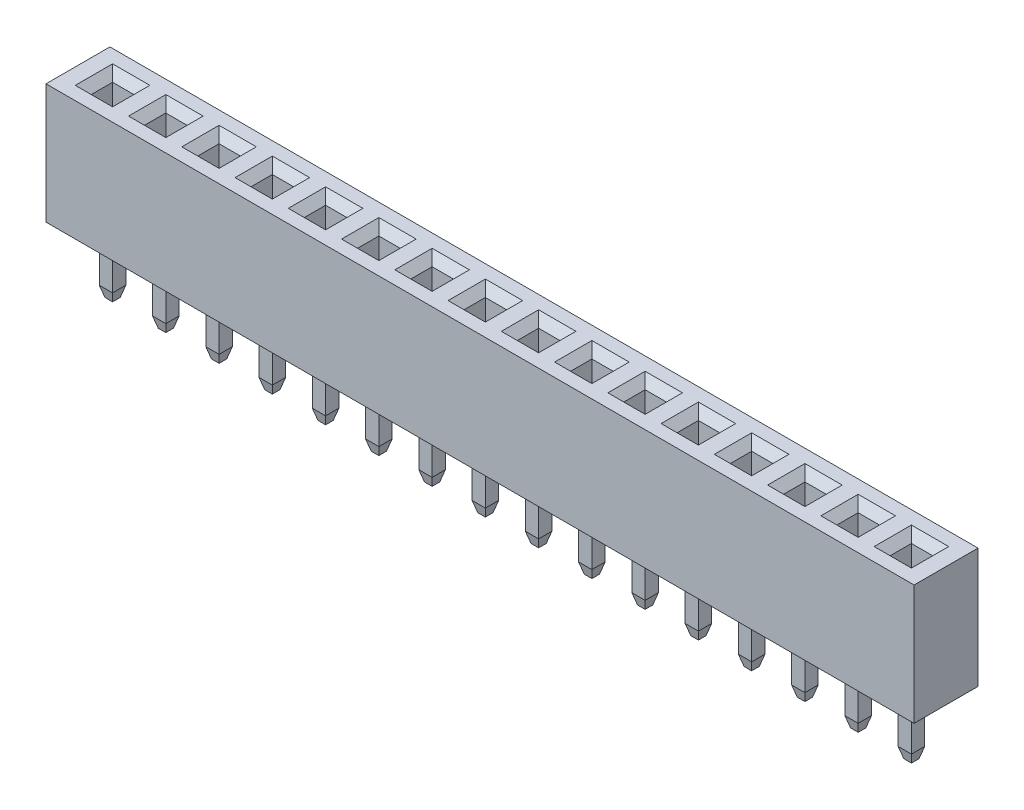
from build123d import *
from OCP.BRepFilletAPI import BRepFilletAPI_MakeChamfer

# Parameters (mm, degrees)
SKETCH_2_W                          = 2.6
SKETCH_2_H                          = 2.4
EXTRUDE_2_DEPTH                     = 4.5
SKETCH_3_W                          = 0.8
SKETCH_3_H                          = 0.8
CUT_EXTRUDE_1_DEPTH                 = 4
CHAMFER_3_SIZE                      = 0.3
SKETCH_1_W                          = 0.5
SKETCH_1_H                          = 0.5
EXTRUDE_1_DEPTH                     = 2.4
CHAMFER_1_SIZE                      = 0.4
CHAMFER_1_SIZE2                     = 0.107179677
PATTERN_LINEAR_1_COUNT              = 16
PATTERN_LINEAR_1_PITCH              = 2
CHAMFER_3_OF_PATTERN_LINEAR_1_SIZE  = 0.3
PATTERN_LINEAR_3_COUNT              = 100
PATTERN_LINEAR_3_PITCH              = 2
CHAMFER_1_OF_PATTERN_LINEAR_3_SIZE  = 0.4
CHAMFER_1_OF_PATTERN_LINEAR_3_SIZE2 = 0.107179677


with BuildPart() as part:
    # Sketch 2 → Extrude 2 (new body)
    with BuildSketch(Plane(origin=(0, 0, 0), x_dir=(1, 0, 0), z_dir=(0, 1, 0))):
        Rectangle(SKETCH_2_W, SKETCH_2_H)
    extrude_2 = extrude(amount=EXTRUDE_2_DEPTH)

    # Sketch 3 → Cut-Extrude 1 (cut)
    with BuildSketch(Plane(origin=(0, 4.5, 0), x_dir=(-1, 0, 0), z_dir=(0, 1, 0))):
        Rectangle(SKETCH_3_W, SKETCH_3_H)
    cut_extrude_1 = extrude(amount=-CUT_EXTRUDE_1_DEPTH, mode=Mode.SUBTRACT)

    # Chamfer 3
    chamfer_3_edges = [part.edges().sort_by_distance(p)[0] for p in [
        (-0.4, 4.5, 0),
        (0, 4.5, 0.4),
        (0.4, 4.5, 0),
        (0, 4.5, -0.4),
    ]]
    chamfer(chamfer_3_edges, length=CHAMFER_3_SIZE)

    # Sketch 1 → Extrude 1 (add)
    with BuildSketch(Plane(origin=(0, 0, 0), x_dir=(1, 0, 0), z_dir=(0, 1, 0))):
        Rectangle(SKETCH_1_W, SKETCH_1_H)
    extrude_1 = extrude(amount=-EXTRUDE_1_DEPTH)

    # Chamfer 1: one chamfer whose edges measure the first distance from different faces: ONE call of the kernel's chamfer builder (chamfer() names one face for all edges)
    chamfer_1_edges_1 = [part.edges().sort_by_distance(p)[0] for p in [
        (-0.25, -2.4, 0),
    ]]
    chamfer_1_side_1 = [part.faces().sort_by_distance(p)[0] for p in [
        (-0.25, -1.2, 0),
    ]]
    chamfer_1_edges_2 = [part.edges().sort_by_distance(p)[0] for p in [
        (0, -2.4, -0.25),
    ]]
    chamfer_1_side_2 = [part.faces().sort_by_distance(p)[0] for p in [
        (0, -1.2, -0.25),
    ]]
    chamfer_1_edges_3 = [part.edges().sort_by_distance(p)[0] for p in [
        (0.25, -2.4, 0),
    ]]
    chamfer_1_side_3 = [part.faces().sort_by_distance(p)[0] for p in [
        (0.25, -1.2, 0),
    ]]
    chamfer_1_edges_4 = [part.edges().sort_by_distance(p)[0] for p in [
        (0, -2.4, 0.25),
    ]]
    chamfer_1_side_4 = [part.faces().sort_by_distance(p)[0] for p in [
        (0, -1.2, 0.25),
    ]]
    chamfer_1 = BRepFilletAPI_MakeChamfer(part.part.solid().wrapped)
    for e in chamfer_1_edges_1:
        chamfer_1.Add(CHAMFER_1_SIZE, CHAMFER_1_SIZE2, e.wrapped, chamfer_1_side_1[0].wrapped)  # the first distance lies on this face
    for e in chamfer_1_edges_2:
        chamfer_1.Add(CHAMFER_1_SIZE, CHAMFER_1_SIZE2, e.wrapped, chamfer_1_side_2[0].wrapped)  # the first distance lies on this face
    for e in chamfer_1_edges_3:
        chamfer_1.Add(CHAMFER_1_SIZE, CHAMFER_1_SIZE2, e.wrapped, chamfer_1_side_3[0].wrapped)  # the first distance lies on this face
    for e in chamfer_1_edges_4:
        chamfer_1.Add(CHAMFER_1_SIZE, CHAMFER_1_SIZE2, e.wrapped, chamfer_1_side_4[0].wrapped)  # the first distance lies on this face
    add(Compound.cast(chamfer_1.Shape()), mode=Mode.REPLACE)

    # Pattern Linear 1: Extrude 2, Cut-Extrude 1 ×16
    with Locations(*[(-i * PATTERN_LINEAR_1_PITCH, 0, 0) for i in range(1, PATTERN_LINEAR_1_COUNT)]):
        add(extrude_2)
        add(cut_extrude_1, mode=Mode.SUBTRACT)

    # Chamfer 3 of Pattern Linear 1
    chamfer_3_of_pattern_linear_1_edges = [part.edges().sort_by_distance(p)[0] for p in [
        (-2.4, 4.5, 0),
        (-2, 4.5, 0.4),
        (-1.6, 4.5, 0),
        (-2, 4.5, -0.4),
        (-4.4, 4.5, 0),
        (-4, 4.5, 0.4),
        (-3.6, 4.5, 0),
        (-4, 4.5, -0.4),
        (-6.4, 4.5, 0),
        (-6, 4.5, 0.4),
        (-5.6, 4.5, 0),
        (-6, 4.5, -0.4),
        (-8.4, 4.5, 0),
        (-8, 4.5, 0.4),
        (-7.6, 4.5, 0),
        (-8, 4.5, -0.4),
        (-10.4, 4.5, 0),
        (-10, 4.5, 0.4),
        (-9.6, 4.5, 0),
        (-10, 4.5, -0.4),
        (-12.4, 4.5, 0),
        (-12, 4.5, 0.4),
        (-11.6, 4.5, 0),
        (-12, 4.5, -0.4),
        (-14.4, 4.5, 0),
        (-14, 4.5, 0.4),
        (-13.6, 4.5, 0),
        (-14, 4.5, -0.4),
        (-16.4, 4.5, 0),
        (-16, 4.5, 0.4),
        (-15.6, 4.5, 0),
        (-16, 4.5, -0.4),
        (-18.4, 4.5, 0),
        (-18, 4.5, 0.4),
        (-17.6, 4.5, 0),
        (-18, 4.5, -0.4),
        (-20.4, 4.5, 0),
        (-20, 4.5, 0.4),
        (-19.6, 4.5, 0),
        (-20, 4.5, -0.4),
        (-22.4, 4.5, 0),
        (-22, 4.5, 0.4),
        (-21.6, 4.5, 0),
        (-22, 4.5, -0.4),
        (-24.4, 4.5, 0),
        (-24, 4.5, 0.4),
        (-23.6, 4.5, 0),
        (-24, 4.5, -0.4),
        (-26.4, 4.5, 0),
        (-26, 4.5, 0.4),
        (-25.6, 4.5, 0),
        (-26, 4.5, -0.4),
        (-28.4, 4.5, 0),
        (-28, 4.5, 0.4),
        (-27.6, 4.5, 0),
        (-28, 4.5, -0.4),
        (-30.4, 4.5, 0),
        (-30, 4.5, 0.4),
        (-29.6, 4.5, 0),
        (-30, 4.5, -0.4),
    ]]
    chamfer(chamfer_3_of_pattern_linear_1_edges, length=CHAMFER_3_OF_PATTERN_LINEAR_1_SIZE)

    # Pattern Linear 3: Extrude 1 ×100, 84 skipped
    with Locations(*[(-i * PATTERN_LINEAR_3_PITCH, 0, 0) for i in range(1, PATTERN_LINEAR_3_COUNT) if i not in (16, 17, 18, 19, 20, 21, 22, 23, 24, 25, 26, 27, 28, 29, 30, 31, 32, 33, 34, 35, 36, 37, 38, 39, 40, 41, 42, 43, 44, 45, 46, 47, 48, 49, 50, 51, 52, 53, 54, 55, 56, 57, 58, 59, 60, 61, 62, 63, 64, 65, 66, 67, 68, 69, 70, 71, 72, 73, 74, 75, 76, 77, 78, 79, 80, 81, 82, 83, 84, 85, 86, 87, 88, 89, 90, 91, 92, 93, 94, 95, 96, 97, 98, 99)]):
        add(extrude_1)

    # Chamfer 1 of Pattern Linear 3: one chamfer whose edges measure the first distance from different faces: ONE call of the kernel's chamfer builder (chamfer() names one face for all edges)
    chamfer_1_of_pattern_linear_3_edges_1 = [part.edges().sort_by_distance(p)[0] for p in [
        (-2.25, -2.4, 0),
    ]]
    chamfer_1_of_pattern_linear_3_side_1 = [part.faces().sort_by_distance(p)[0] for p in [
        (-2.25, -1.2, 0),
    ]]
    chamfer_1_of_pattern_linear_3_edges_2 = [part.edges().sort_by_distance(p)[0] for p in [
        (-2, -2.4, -0.25),
    ]]
    chamfer_1_of_pattern_linear_3_side_2 = [part.faces().sort_by_distance(p)[0] for p in [
        (-2, -1.2, -0.25),
    ]]
    chamfer_1_of_pattern_linear_3_edges_3 = [part.edges().sort_by_distance(p)[0] for p in [
        (-1.75, -2.4, 0),
    ]]
    chamfer_1_of_pattern_linear_3_side_3 = [part.faces().sort_by_distance(p)[0] for p in [
        (-1.75, -1.2, 0),
    ]]
    chamfer_1_of_pattern_linear_3_edges_4 = [part.edges().sort_by_distance(p)[0] for p in [
        (-2, -2.4, 0.25),
    ]]
    chamfer_1_of_pattern_linear_3_side_4 = [part.faces().sort_by_distance(p)[0] for p in [
        (-2, -1.2, 0.25),
    ]]
    chamfer_1_of_pattern_linear_3_edges_5 = [part.edges().sort_by_distance(p)[0] for p in [
        (-4.25, -2.4, 0),
    ]]
    chamfer_1_of_pattern_linear_3_side_5 = [part.faces().sort_by_distance(p)[0] for p in [
        (-4.25, -1.2, 0),
    ]]
    chamfer_1_of_pattern_linear_3_edges_6 = [part.edges().sort_by_distance(p)[0] for p in [
        (-4, -2.4, -0.25),
    ]]
    chamfer_1_of_pattern_linear_3_side_6 = [part.faces().sort_by_distance(p)[0] for p in [
        (-4, -1.2, -0.25),
    ]]
    chamfer_1_of_pattern_linear_3_edges_7 = [part.edges().sort_by_distance(p)[0] for p in [
        (-3.75, -2.4, 0),
    ]]
    chamfer_1_of_pattern_linear_3_side_7 = [part.faces().sort_by_distance(p)[0] for p in [
        (-3.75, -1.2, 0),
    ]]
    chamfer_1_of_pattern_linear_3_edges_8 = [part.edges().sort_by_distance(p)[0] for p in [
        (-4, -2.4, 0.25),
    ]]
    chamfer_1_of_pattern_linear_3_side_8 = [part.faces().sort_by_distance(p)[0] for p in [
        (-4, -1.2, 0.25),
    ]]
    chamfer_1_of_pattern_linear_3_edges_9 = [part.edges().sort_by_distance(p)[0] for p in [
        (-6.25, -2.4, 0),
    ]]
    chamfer_1_of_pattern_linear_3_side_9 = [part.faces().sort_by_distance(p)[0] for p in [
        (-6.25, -1.2, 0),
    ]]
    chamfer_1_of_pattern_linear_3_edges_10 = [part.edges().sort_by_distance(p)[0] for p in [
        (-6, -2.4, -0.25),
    ]]
    chamfer_1_of_pattern_linear_3_side_10 = [part.faces().sort_by_distance(p)[0] for p in [
        (-6, -1.2, -0.25),
    ]]
    chamfer_1_of_pattern_linear_3_edges_11 = [part.edges().sort_by_distance(p)[0] for p in [
        (-5.75, -2.4, 0),
    ]]
    chamfer_1_of_pattern_linear_3_side_11 = [part.faces().sort_by_distance(p)[0] for p in [
        (-5.75, -1.2, 0),
    ]]
    chamfer_1_of_pattern_linear_3_edges_12 = [part.edges().sort_by_distance(p)[0] for p in [
        (-6, -2.4, 0.25),
    ]]
    chamfer_1_of_pattern_linear_3_side_12 = [part.faces().sort_by_distance(p)[0] for p in [
        (-6, -1.2, 0.25),
    ]]
    chamfer_1_of_pattern_linear_3_edges_13 = [part.edges().sort_by_distance(p)[0] for p in [
        (-8.25, -2.4, 0),
    ]]
    chamfer_1_of_pattern_linear_3_side_13 = [part.faces().sort_by_distance(p)[0] for p in [
        (-8.25, -1.2, 0),
    ]]
    chamfer_1_of_pattern_linear_3_edges_14 = [part.edges().sort_by_distance(p)[0] for p in [
        (-8, -2.4, -0.25),
    ]]
    chamfer_1_of_pattern_linear_3_side_14 = [part.faces().sort_by_distance(p)[0] for p in [
        (-8, -1.2, -0.25),
    ]]
    chamfer_1_of_pattern_linear_3_edges_15 = [part.edges().sort_by_distance(p)[0] for p in [
        (-7.75, -2.4, 0),
    ]]
    chamfer_1_of_pattern_linear_3_side_15 = [part.faces().sort_by_distance(p)[0] for p in [
        (-7.75, -1.2, 0),
    ]]
    chamfer_1_of_pattern_linear_3_edges_16 = [part.edges().sort_by_distance(p)[0] for p in [
        (-8, -2.4, 0.25),
    ]]
    chamfer_1_of_pattern_linear_3_side_16 = [part.faces().sort_by_distance(p)[0] for p in [
        (-8, -1.2, 0.25),
    ]]
    chamfer_1_of_pattern_linear_3_edges_17 = [part.edges().sort_by_distance(p)[0] for p in [
        (-10.25, -2.4, 0),
    ]]
    chamfer_1_of_pattern_linear_3_side_17 = [part.faces().sort_by_distance(p)[0] for p in [
        (-10.25, -1.2, 0),
    ]]
    chamfer_1_of_pattern_linear_3_edges_18 = [part.edges().sort_by_distance(p)[0] for p in [
        (-10, -2.4, -0.25),
    ]]
    chamfer_1_of_pattern_linear_3_side_18 = [part.faces().sort_by_distance(p)[0] for p in [
        (-10, -1.2, -0.25),
    ]]
    chamfer_1_of_pattern_linear_3_edges_19 = [part.edges().sort_by_distance(p)[0] for p in [
        (-9.75, -2.4, 0),
    ]]
    chamfer_1_of_pattern_linear_3_side_19 = [part.faces().sort_by_distance(p)[0] for p in [
        (-9.75, -1.2, 0),
    ]]
    chamfer_1_of_pattern_linear_3_edges_20 = [part.edges().sort_by_distance(p)[0] for p in [
        (-10, -2.4, 0.25),
    ]]
    chamfer_1_of_pattern_linear_3_side_20 = [part.faces().sort_by_distance(p)[0] for p in [
        (-10, -1.2, 0.25),
    ]]
    chamfer_1_of_pattern_linear_3_edges_21 = [part.edges().sort_by_distance(p)[0] for p in [
        (-12.25, -2.4, 0),
    ]]
    chamfer_1_of_pattern_linear_3_side_21 = [part.faces().sort_by_distance(p)[0] for p in [
        (-12.25, -1.2, 0),
    ]]
    chamfer_1_of_pattern_linear_3_edges_22 = [part.edges().sort_by_distance(p)[0] for p in [
        (-12, -2.4, -0.25),
    ]]
    chamfer_1_of_pattern_linear_3_side_22 = [part.faces().sort_by_distance(p)[0] for p in [
        (-12, -1.2, -0.25),
    ]]
    chamfer_1_of_pattern_linear_3_edges_23 = [part.edges().sort_by_distance(p)[0] for p in [
        (-11.75, -2.4, 0),
    ]]
    chamfer_1_of_pattern_linear_3_side_23 = [part.faces().sort_by_distance(p)[0] for p in [
        (-11.75, -1.2, 0),
    ]]
    chamfer_1_of_pattern_linear_3_edges_24 = [part.edges().sort_by_distance(p)[0] for p in [
        (-12, -2.4, 0.25),
    ]]
    chamfer_1_of_pattern_linear_3_side_24 = [part.faces().sort_by_distance(p)[0] for p in [
        (-12, -1.2, 0.25),
    ]]
    chamfer_1_of_pattern_linear_3_edges_25 = [part.edges().sort_by_distance(p)[0] for p in [
        (-14.25, -2.4, 0),
    ]]
    chamfer_1_of_pattern_linear_3_side_25 = [part.faces().sort_by_distance(p)[0] for p in [
        (-14.25, -1.2, 0),
    ]]
    chamfer_1_of_pattern_linear_3_edges_26 = [part.edges().sort_by_distance(p)[0] for p in [
        (-14, -2.4, -0.25),
    ]]
    chamfer_1_of_pattern_linear_3_side_26 = [part.faces().sort_by_distance(p)[0] for p in [
        (-14, -1.2, -0.25),
    ]]
    chamfer_1_of_pattern_linear_3_edges_27 = [part.edges().sort_by_distance(p)[0] for p in [
        (-13.75, -2.4, 0),
    ]]
    chamfer_1_of_pattern_linear_3_side_27 = [part.faces().sort_by_distance(p)[0] for p in [
        (-13.75, -1.2, 0),
    ]]
    chamfer_1_of_pattern_linear_3_edges_28 = [part.edges().sort_by_distance(p)[0] for p in [
        (-14, -2.4, 0.25),
    ]]
    chamfer_1_of_pattern_linear_3_side_28 = [part.faces().sort_by_distance(p)[0] for p in [
        (-14, -1.2, 0.25),
    ]]
    chamfer_1_of_pattern_linear_3_edges_29 = [part.edges().sort_by_distance(p)[0] for p in [
        (-16.25, -2.4, 0),
    ]]
    chamfer_1_of_pattern_linear_3_side_29 = [part.faces().sort_by_distance(p)[0] for p in [
        (-16.25, -1.2, 0),
    ]]
    chamfer_1_of_pattern_linear_3_edges_30 = [part.edges().sort_by_distance(p)[0] for p in [
        (-16, -2.4, -0.25),
    ]]
    chamfer_1_of_pattern_linear_3_side_30 = [part.faces().sort_by_distance(p)[0] for p in [
        (-16, -1.2, -0.25),
    ]]
    chamfer_1_of_pattern_linear_3_edges_31 = [part.edges().sort_by_distance(p)[0] for p in [
        (-15.75, -2.4, 0),
    ]]
    chamfer_1_of_pattern_linear_3_side_31 = [part.faces().sort_by_distance(p)[0] for p in [
        (-15.75, -1.2, 0),
    ]]
    chamfer_1_of_pattern_linear_3_edges_32 = [part.edges().sort_by_distance(p)[0] for p in [
        (-16, -2.4, 0.25),
    ]]
    chamfer_1_of_pattern_linear_3_side_32 = [part.faces().sort_by_distance(p)[0] for p in [
        (-16, -1.2, 0.25),
    ]]
    chamfer_1_of_pattern_linear_3_edges_33 = [part.edges().sort_by_distance(p)[0] for p in [
        (-18.25, -2.4, 0),
    ]]
    chamfer_1_of_pattern_linear_3_side_33 = [part.faces().sort_by_distance(p)[0] for p in [
        (-18.25, -1.2, 0),
    ]]
    chamfer_1_of_pattern_linear_3_edges_34 = [part.edges().sort_by_distance(p)[0] for p in [
        (-18, -2.4, -0.25),
    ]]
    chamfer_1_of_pattern_linear_3_side_34 = [part.faces().sort_by_distance(p)[0] for p in [
        (-18, -1.2, -0.25),
    ]]
    chamfer_1_of_pattern_linear_3_edges_35 = [part.edges().sort_by_distance(p)[0] for p in [
        (-17.75, -2.4, 0),
    ]]
    chamfer_1_of_pattern_linear_3_side_35 = [part.faces().sort_by_distance(p)[0] for p in [
        (-17.75, -1.2, 0),
    ]]
    chamfer_1_of_pattern_linear_3_edges_36 = [part.edges().sort_by_distance(p)[0] for p in [
        (-18, -2.4, 0.25),
    ]]
    chamfer_1_of_pattern_linear_3_side_36 = [part.faces().sort_by_distance(p)[0] for p in [
        (-18, -1.2, 0.25),
    ]]
    chamfer_1_of_pattern_linear_3_edges_37 = [part.edges().sort_by_distance(p)[0] for p in [
        (-20.25, -2.4, 0),
    ]]
    chamfer_1_of_pattern_linear_3_side_37 = [part.faces().sort_by_distance(p)[0] for p in [
        (-20.25, -1.2, 0),
    ]]
    chamfer_1_of_pattern_linear_3_edges_38 = [part.edges().sort_by_distance(p)[0] for p in [
        (-20, -2.4, -0.25),
    ]]
    chamfer_1_of_pattern_linear_3_side_38 = [part.faces().sort_by_distance(p)[0] for p in [
        (-20, -1.2, -0.25),
    ]]
    chamfer_1_of_pattern_linear_3_edges_39 = [part.edges().sort_by_distance(p)[0] for p in [
        (-19.75, -2.4, 0),
    ]]
    chamfer_1_of_pattern_linear_3_side_39 = [part.faces().sort_by_distance(p)[0] for p in [
        (-19.75, -1.2, 0),
    ]]
    chamfer_1_of_pattern_linear_3_edges_40 = [part.edges().sort_by_distance(p)[0] for p in [
        (-20, -2.4, 0.25),
    ]]
    chamfer_1_of_pattern_linear_3_side_40 = [part.faces().sort_by_distance(p)[0] for p in [
        (-20, -1.2, 0.25),
    ]]
    chamfer_1_of_pattern_linear_3_edges_41 = [part.edges().sort_by_distance(p)[0] for p in [
        (-22.25, -2.4, 0),
    ]]
    chamfer_1_of_pattern_linear_3_side_41 = [part.faces().sort_by_distance(p)[0] for p in [
        (-22.25, -1.2, 0),
    ]]
    chamfer_1_of_pattern_linear_3_edges_42 = [part.edges().sort_by_distance(p)[0] for p in [
        (-22, -2.4, -0.25),
    ]]
    chamfer_1_of_pattern_linear_3_side_42 = [part.faces().sort_by_distance(p)[0] for p in [
        (-22, -1.2, -0.25),
    ]]
    chamfer_1_of_pattern_linear_3_edges_43 = [part.edges().sort_by_distance(p)[0] for p in [
        (-21.75, -2.4, 0),
    ]]
    chamfer_1_of_pattern_linear_3_side_43 = [part.faces().sort_by_distance(p)[0] for p in [
        (-21.75, -1.2, 0),
    ]]
    chamfer_1_of_pattern_linear_3_edges_44 = [part.edges().sort_by_distance(p)[0] for p in [
        (-22, -2.4, 0.25),
    ]]
    chamfer_1_of_pattern_linear_3_side_44 = [part.faces().sort_by_distance(p)[0] for p in [
        (-22, -1.2, 0.25),
    ]]
    chamfer_1_of_pattern_linear_3_edges_45 = [part.edges().sort_by_distance(p)[0] for p in [
        (-24.25, -2.4, 0),
    ]]
    chamfer_1_of_pattern_linear_3_side_45 = [part.faces().sort_by_distance(p)[0] for p in [
        (-24.25, -1.2, 0),
    ]]
    chamfer_1_of_pattern_linear_3_edges_46 = [part.edges().sort_by_distance(p)[0] for p in [
        (-24, -2.4, -0.25),
    ]]
    chamfer_1_of_pattern_linear_3_side_46 = [part.faces().sort_by_distance(p)[0] for p in [
        (-24, -1.2, -0.25),
    ]]
    chamfer_1_of_pattern_linear_3_edges_47 = [part.edges().sort_by_distance(p)[0] for p in [
        (-23.75, -2.4, 0),
    ]]
    chamfer_1_of_pattern_linear_3_side_47 = [part.faces().sort_by_distance(p)[0] for p in [
        (-23.75, -1.2, 0),
    ]]
    chamfer_1_of_pattern_linear_3_edges_48 = [part.edges().sort_by_distance(p)[0] for p in [
        (-24, -2.4, 0.25),
    ]]
    chamfer_1_of_pattern_linear_3_side_48 = [part.faces().sort_by_distance(p)[0] for p in [
        (-24, -1.2, 0.25),
    ]]
    chamfer_1_of_pattern_linear_3_edges_49 = [part.edges().sort_by_distance(p)[0] for p in [
        (-26.25, -2.4, 0),
    ]]
    chamfer_1_of_pattern_linear_3_side_49 = [part.faces().sort_by_distance(p)[0] for p in [
        (-26.25, -1.2, 0),
    ]]
    chamfer_1_of_pattern_linear_3_edges_50 = [part.edges().sort_by_distance(p)[0] for p in [
        (-26, -2.4, -0.25),
    ]]
    chamfer_1_of_pattern_linear_3_side_50 = [part.faces().sort_by_distance(p)[0] for p in [
        (-26, -1.2, -0.25),
    ]]
    chamfer_1_of_pattern_linear_3_edges_51 = [part.edges().sort_by_distance(p)[0] for p in [
        (-25.75, -2.4, 0),
    ]]
    chamfer_1_of_pattern_linear_3_side_51 = [part.faces().sort_by_distance(p)[0] for p in [
        (-25.75, -1.2, 0),
    ]]
    chamfer_1_of_pattern_linear_3_edges_52 = [part.edges().sort_by_distance(p)[0] for p in [
        (-26, -2.4, 0.25),
    ]]
    chamfer_1_of_pattern_linear_3_side_52 = [part.faces().sort_by_distance(p)[0] for p in [
        (-26, -1.2, 0.25),
    ]]
    chamfer_1_of_pattern_linear_3_edges_53 = [part.edges().sort_by_distance(p)[0] for p in [
        (-28.25, -2.4, 0),
    ]]
    chamfer_1_of_pattern_linear_3_side_53 = [part.faces().sort_by_distance(p)[0] for p in [
        (-28.25, -1.2, 0),
    ]]
    chamfer_1_of_pattern_linear_3_edges_54 = [part.edges().sort_by_distance(p)[0] for p in [
        (-28, -2.4, -0.25),
    ]]
    chamfer_1_of_pattern_linear_3_side_54 = [part.faces().sort_by_distance(p)[0] for p in [
        (-28, -1.2, -0.25),
    ]]
    chamfer_1_of_pattern_linear_3_edges_55 = [part.edges().sort_by_distance(p)[0] for p in [
        (-27.75, -2.4, 0),
    ]]
    chamfer_1_of_pattern_linear_3_side_55 = [part.faces().sort_by_distance(p)[0] for p in [
        (-27.75, -1.2, 0),
    ]]
    chamfer_1_of_pattern_linear_3_edges_56 = [part.edges().sort_by_distance(p)[0] for p in [
        (-28, -2.4, 0.25),
    ]]
    chamfer_1_of_pattern_linear_3_side_56 = [part.faces().sort_by_distance(p)[0] for p in [
        (-28, -1.2, 0.25),
    ]]
    chamfer_1_of_pattern_linear_3_edges_57 = [part.edges().sort_by_distance(p)[0] for p in [
        (-30.25, -2.4, 0),
    ]]
    chamfer_1_of_pattern_linear_3_side_57 = [part.faces().sort_by_distance(p)[0] for p in [
        (-30.25, -1.2, 0),
    ]]
    chamfer_1_of_pattern_linear_3_edges_58 = [part.edges().sort_by_distance(p)[0] for p in [
        (-30, -2.4, -0.25),
    ]]
    chamfer_1_of_pattern_linear_3_side_58 = [part.faces().sort_by_distance(p)[0] for p in [
        (-30, -1.2, -0.25),
    ]]
    chamfer_1_of_pattern_linear_3_edges_59 = [part.edges().sort_by_distance(p)[0] for p in [
        (-29.75, -2.4, 0),
    ]]
    chamfer_1_of_pattern_linear_3_side_59 = [part.faces().sort_by_distance(p)[0] for p in [
        (-29.75, -1.2, 0),
    ]]
    chamfer_1_of_pattern_linear_3_edges_60 = [part.edges().sort_by_distance(p)[0] for p in [
        (-30, -2.4, 0.25),
    ]]
    chamfer_1_of_pattern_linear_3_side_60 = [part.faces().sort_by_distance(p)[0] for p in [
        (-30, -1.2, 0.25),
    ]]
    chamfer_1_of_pattern_linear_3 = BRepFilletAPI_MakeChamfer(part.part.solid().wrapped)
    for e in chamfer_1_of_pattern_linear_3_edges_1:
        chamfer_1_of_pattern_linear_3.Add(CHAMFER_1_OF_PATTERN_LINEAR_3_SIZE, CHAMFER_1_OF_PATTERN_LINEAR_3_SIZE2, e.wrapped, chamfer_1_of_pattern_linear_3_side_1[0].wrapped)  # the first distance lies on this face
    for e in chamfer_1_of_pattern_linear_3_edges_2:
        chamfer_1_of_pattern_linear_3.Add(CHAMFER_1_OF_PATTERN_LINEAR_3_SIZE, CHAMFER_1_OF_PATTERN_LINEAR_3_SIZE2, e.wrapped, chamfer_1_of_pattern_linear_3_side_2[0].wrapped)  # the first distance lies on this face
    for e in chamfer_1_of_pattern_linear_3_edges_3:
        chamfer_1_of_pattern_linear_3.Add(CHAMFER_1_OF_PATTERN_LINEAR_3_SIZE, CHAMFER_1_OF_PATTERN_LINEAR_3_SIZE2, e.wrapped, chamfer_1_of_pattern_linear_3_side_3[0].wrapped)  # the first distance lies on this face
    for e in chamfer_1_of_pattern_linear_3_edges_4:
        chamfer_1_of_pattern_linear_3.Add(CHAMFER_1_OF_PATTERN_LINEAR_3_SIZE, CHAMFER_1_OF_PATTERN_LINEAR_3_SIZE2, e.wrapped, chamfer_1_of_pattern_linear_3_side_4[0].wrapped)  # the first distance lies on this face
    for e in chamfer_1_of_pattern_linear_3_edges_5:
        chamfer_1_of_pattern_linear_3.Add(CHAMFER_1_OF_PATTERN_LINEAR_3_SIZE, CHAMFER_1_OF_PATTERN_LINEAR_3_SIZE2, e.wrapped, chamfer_1_of_pattern_linear_3_side_5[0].wrapped)  # the first distance lies on this face
    for e in chamfer_1_of_pattern_linear_3_edges_6:
        chamfer_1_of_pattern_linear_3.Add(CHAMFER_1_OF_PATTERN_LINEAR_3_SIZE, CHAMFER_1_OF_PATTERN_LINEAR_3_SIZE2, e.wrapped, chamfer_1_of_pattern_linear_3_side_6[0].wrapped)  # the first distance lies on this face
    for e in chamfer_1_of_pattern_linear_3_edges_7:
        chamfer_1_of_pattern_linear_3.Add(CHAMFER_1_OF_PATTERN_LINEAR_3_SIZE, CHAMFER_1_OF_PATTERN_LINEAR_3_SIZE2, e.wrapped, chamfer_1_of_pattern_linear_3_side_7[0].wrapped)  # the first distance lies on this face
    for e in chamfer_1_of_pattern_linear_3_edges_8:
        chamfer_1_of_pattern_linear_3.Add(CHAMFER_1_OF_PATTERN_LINEAR_3_SIZE, CHAMFER_1_OF_PATTERN_LINEAR_3_SIZE2, e.wrapped, chamfer_1_of_pattern_linear_3_side_8[0].wrapped)  # the first distance lies on this face
    for e in chamfer_1_of_pattern_linear_3_edges_9:
        chamfer_1_of_pattern_linear_3.Add(CHAMFER_1_OF_PATTERN_LINEAR_3_SIZE, CHAMFER_1_OF_PATTERN_LINEAR_3_SIZE2, e.wrapped, chamfer_1_of_pattern_linear_3_side_9[0].wrapped)  # the first distance lies on this face
    for e in chamfer_1_of_pattern_linear_3_edges_10:
        chamfer_1_of_pattern_linear_3.Add(CHAMFER_1_OF_PATTERN_LINEAR_3_SIZE, CHAMFER_1_OF_PATTERN_LINEAR_3_SIZE2, e.wrapped, chamfer_1_of_pattern_linear_3_side_10[0].wrapped)  # the first distance lies on this face
    for e in chamfer_1_of_pattern_linear_3_edges_11:
        chamfer_1_of_pattern_linear_3.Add(CHAMFER_1_OF_PATTERN_LINEAR_3_SIZE, CHAMFER_1_OF_PATTERN_LINEAR_3_SIZE2, e.wrapped, chamfer_1_of_pattern_linear_3_side_11[0].wrapped)  # the first distance lies on this face
    for e in chamfer_1_of_pattern_linear_3_edges_12:
        chamfer_1_of_pattern_linear_3.Add(CHAMFER_1_OF_PATTERN_LINEAR_3_SIZE, CHAMFER_1_OF_PATTERN_LINEAR_3_SIZE2, e.wrapped, chamfer_1_of_pattern_linear_3_side_12[0].wrapped)  # the first distance lies on this face
    for e in chamfer_1_of_pattern_linear_3_edges_13:
        chamfer_1_of_pattern_linear_3.Add(CHAMFER_1_OF_PATTERN_LINEAR_3_SIZE, CHAMFER_1_OF_PATTERN_LINEAR_3_SIZE2, e.wrapped, chamfer_1_of_pattern_linear_3_side_13[0].wrapped)  # the first distance lies on this face
    for e in chamfer_1_of_pattern_linear_3_edges_14:
        chamfer_1_of_pattern_linear_3.Add(CHAMFER_1_OF_PATTERN_LINEAR_3_SIZE, CHAMFER_1_OF_PATTERN_LINEAR_3_SIZE2, e.wrapped, chamfer_1_of_pattern_linear_3_side_14[0].wrapped)  # the first distance lies on this face
    for e in chamfer_1_of_pattern_linear_3_edges_15:
        chamfer_1_of_pattern_linear_3.Add(CHAMFER_1_OF_PATTERN_LINEAR_3_SIZE, CHAMFER_1_OF_PATTERN_LINEAR_3_SIZE2, e.wrapped, chamfer_1_of_pattern_linear_3_side_15[0].wrapped)  # the first distance lies on this face
    for e in chamfer_1_of_pattern_linear_3_edges_16:
        chamfer_1_of_pattern_linear_3.Add(CHAMFER_1_OF_PATTERN_LINEAR_3_SIZE, CHAMFER_1_OF_PATTERN_LINEAR_3_SIZE2, e.wrapped, chamfer_1_of_pattern_linear_3_side_16[0].wrapped)  # the first distance lies on this face
    for e in chamfer_1_of_pattern_linear_3_edges_17:
        chamfer_1_of_pattern_linear_3.Add(CHAMFER_1_OF_PATTERN_LINEAR_3_SIZE, CHAMFER_1_OF_PATTERN_LINEAR_3_SIZE2, e.wrapped, chamfer_1_of_pattern_linear_3_side_17[0].wrapped)  # the first distance lies on this face
    for e in chamfer_1_of_pattern_linear_3_edges_18:
        chamfer_1_of_pattern_linear_3.Add(CHAMFER_1_OF_PATTERN_LINEAR_3_SIZE, CHAMFER_1_OF_PATTERN_LINEAR_3_SIZE2, e.wrapped, chamfer_1_of_pattern_linear_3_side_18[0].wrapped)  # the first distance lies on this face
    for e in chamfer_1_of_pattern_linear_3_edges_19:
        chamfer_1_of_pattern_linear_3.Add(CHAMFER_1_OF_PATTERN_LINEAR_3_SIZE, CHAMFER_1_OF_PATTERN_LINEAR_3_SIZE2, e.wrapped, chamfer_1_of_pattern_linear_3_side_19[0].wrapped)  # the first distance lies on this face
    for e in chamfer_1_of_pattern_linear_3_edges_20:
        chamfer_1_of_pattern_linear_3.Add(CHAMFER_1_OF_PATTERN_LINEAR_3_SIZE, CHAMFER_1_OF_PATTERN_LINEAR_3_SIZE2, e.wrapped, chamfer_1_of_pattern_linear_3_side_20[0].wrapped)  # the first distance lies on this face
    for e in chamfer_1_of_pattern_linear_3_edges_21:
        chamfer_1_of_pattern_linear_3.Add(CHAMFER_1_OF_PATTERN_LINEAR_3_SIZE, CHAMFER_1_OF_PATTERN_LINEAR_3_SIZE2, e.wrapped, chamfer_1_of_pattern_linear_3_side_21[0].wrapped)  # the first distance lies on this face
    for e in chamfer_1_of_pattern_linear_3_edges_22:
        chamfer_1_of_pattern_linear_3.Add(CHAMFER_1_OF_PATTERN_LINEAR_3_SIZE, CHAMFER_1_OF_PATTERN_LINEAR_3_SIZE2, e.wrapped, chamfer_1_of_pattern_linear_3_side_22[0].wrapped)  # the first distance lies on this face
    for e in chamfer_1_of_pattern_linear_3_edges_23:
        chamfer_1_of_pattern_linear_3.Add(CHAMFER_1_OF_PATTERN_LINEAR_3_SIZE, CHAMFER_1_OF_PATTERN_LINEAR_3_SIZE2, e.wrapped, chamfer_1_of_pattern_linear_3_side_23[0].wrapped)  # the first distance lies on this face
    for e in chamfer_1_of_pattern_linear_3_edges_24:
        chamfer_1_of_pattern_linear_3.Add(CHAMFER_1_OF_PATTERN_LINEAR_3_SIZE, CHAMFER_1_OF_PATTERN_LINEAR_3_SIZE2, e.wrapped, chamfer_1_of_pattern_linear_3_side_24[0].wrapped)  # the first distance lies on this face
    for e in chamfer_1_of_pattern_linear_3_edges_25:
        chamfer_1_of_pattern_linear_3.Add(CHAMFER_1_OF_PATTERN_LINEAR_3_SIZE, CHAMFER_1_OF_PATTERN_LINEAR_3_SIZE2, e.wrapped, chamfer_1_of_pattern_linear_3_side_25[0].wrapped)  # the first distance lies on this face
    for e in chamfer_1_of_pattern_linear_3_edges_26:
        chamfer_1_of_pattern_linear_3.Add(CHAMFER_1_OF_PATTERN_LINEAR_3_SIZE, CHAMFER_1_OF_PATTERN_LINEAR_3_SIZE2, e.wrapped, chamfer_1_of_pattern_linear_3_side_26[0].wrapped)  # the first distance lies on this face
    for e in chamfer_1_of_pattern_linear_3_edges_27:
        chamfer_1_of_pattern_linear_3.Add(CHAMFER_1_OF_PATTERN_LINEAR_3_SIZE, CHAMFER_1_OF_PATTERN_LINEAR_3_SIZE2, e.wrapped, chamfer_1_of_pattern_linear_3_side_27[0].wrapped)  # the first distance lies on this face
    for e in chamfer_1_of_pattern_linear_3_edges_28:
        chamfer_1_of_pattern_linear_3.Add(CHAMFER_1_OF_PATTERN_LINEAR_3_SIZE, CHAMFER_1_OF_PATTERN_LINEAR_3_SIZE2, e.wrapped, chamfer_1_of_pattern_linear_3_side_28[0].wrapped)  # the first distance lies on this face
    for e in chamfer_1_of_pattern_linear_3_edges_29:
        chamfer_1_of_pattern_linear_3.Add(CHAMFER_1_OF_PATTERN_LINEAR_3_SIZE, CHAMFER_1_OF_PATTERN_LINEAR_3_SIZE2, e.wrapped, chamfer_1_of_pattern_linear_3_side_29[0].wrapped)  # the first distance lies on this face
    for e in chamfer_1_of_pattern_linear_3_edges_30:
        chamfer_1_of_pattern_linear_3.Add(CHAMFER_1_OF_PATTERN_LINEAR_3_SIZE, CHAMFER_1_OF_PATTERN_LINEAR_3_SIZE2, e.wrapped, chamfer_1_of_pattern_linear_3_side_30[0].wrapped)  # the first distance lies on this face
    for e in chamfer_1_of_pattern_linear_3_edges_31:
        chamfer_1_of_pattern_linear_3.Add(CHAMFER_1_OF_PATTERN_LINEAR_3_SIZE, CHAMFER_1_OF_PATTERN_LINEAR_3_SIZE2, e.wrapped, chamfer_1_of_pattern_linear_3_side_31[0].wrapped)  # the first distance lies on this face
    for e in chamfer_1_of_pattern_linear_3_edges_32:
        chamfer_1_of_pattern_linear_3.Add(CHAMFER_1_OF_PATTERN_LINEAR_3_SIZE, CHAMFER_1_OF_PATTERN_LINEAR_3_SIZE2, e.wrapped, chamfer_1_of_pattern_linear_3_side_32[0].wrapped)  # the first distance lies on this face
    for e in chamfer_1_of_pattern_linear_3_edges_33:
        chamfer_1_of_pattern_linear_3.Add(CHAMFER_1_OF_PATTERN_LINEAR_3_SIZE, CHAMFER_1_OF_PATTERN_LINEAR_3_SIZE2, e.wrapped, chamfer_1_of_pattern_linear_3_side_33[0].wrapped)  # the first distance lies on this face
    for e in chamfer_1_of_pattern_linear_3_edges_34:
        chamfer_1_of_pattern_linear_3.Add(CHAMFER_1_OF_PATTERN_LINEAR_3_SIZE, CHAMFER_1_OF_PATTERN_LINEAR_3_SIZE2, e.wrapped, chamfer_1_of_pattern_linear_3_side_34[0].wrapped)  # the first distance lies on this face
    for e in chamfer_1_of_pattern_linear_3_edges_35:
        chamfer_1_of_pattern_linear_3.Add(CHAMFER_1_OF_PATTERN_LINEAR_3_SIZE, CHAMFER_1_OF_PATTERN_LINEAR_3_SIZE2, e.wrapped, chamfer_1_of_pattern_linear_3_side_35[0].wrapped)  # the first distance lies on this face
    for e in chamfer_1_of_pattern_linear_3_edges_36:
        chamfer_1_of_pattern_linear_3.Add(CHAMFER_1_OF_PATTERN_LINEAR_3_SIZE, CHAMFER_1_OF_PATTERN_LINEAR_3_SIZE2, e.wrapped, chamfer_1_of_pattern_linear_3_side_36[0].wrapped)  # the first distance lies on this face
    for e in chamfer_1_of_pattern_linear_3_edges_37:
        chamfer_1_of_pattern_linear_3.Add(CHAMFER_1_OF_PATTERN_LINEAR_3_SIZE, CHAMFER_1_OF_PATTERN_LINEAR_3_SIZE2, e.wrapped, chamfer_1_of_pattern_linear_3_side_37[0].wrapped)  # the first distance lies on this face
    for e in chamfer_1_of_pattern_linear_3_edges_38:
        chamfer_1_of_pattern_linear_3.Add(CHAMFER_1_OF_PATTERN_LINEAR_3_SIZE, CHAMFER_1_OF_PATTERN_LINEAR_3_SIZE2, e.wrapped, chamfer_1_of_pattern_linear_3_side_38[0].wrapped)  # the first distance lies on this face
    for e in chamfer_1_of_pattern_linear_3_edges_39:
        chamfer_1_of_pattern_linear_3.Add(CHAMFER_1_OF_PATTERN_LINEAR_3_SIZE, CHAMFER_1_OF_PATTERN_LINEAR_3_SIZE2, e.wrapped, chamfer_1_of_pattern_linear_3_side_39[0].wrapped)  # the first distance lies on this face
    for e in chamfer_1_of_pattern_linear_3_edges_40:
        chamfer_1_of_pattern_linear_3.Add(CHAMFER_1_OF_PATTERN_LINEAR_3_SIZE, CHAMFER_1_OF_PATTERN_LINEAR_3_SIZE2, e.wrapped, chamfer_1_of_pattern_linear_3_side_40[0].wrapped)  # the first distance lies on this face
    for e in chamfer_1_of_pattern_linear_3_edges_41:
        chamfer_1_of_pattern_linear_3.Add(CHAMFER_1_OF_PATTERN_LINEAR_3_SIZE, CHAMFER_1_OF_PATTERN_LINEAR_3_SIZE2, e.wrapped, chamfer_1_of_pattern_linear_3_side_41[0].wrapped)  # the first distance lies on this face
    for e in chamfer_1_of_pattern_linear_3_edges_42:
        chamfer_1_of_pattern_linear_3.Add(CHAMFER_1_OF_PATTERN_LINEAR_3_SIZE, CHAMFER_1_OF_PATTERN_LINEAR_3_SIZE2, e.wrapped, chamfer_1_of_pattern_linear_3_side_42[0].wrapped)  # the first distance lies on this face
    for e in chamfer_1_of_pattern_linear_3_edges_43:
        chamfer_1_of_pattern_linear_3.Add(CHAMFER_1_OF_PATTERN_LINEAR_3_SIZE, CHAMFER_1_OF_PATTERN_LINEAR_3_SIZE2, e.wrapped, chamfer_1_of_pattern_linear_3_side_43[0].wrapped)  # the first distance lies on this face
    for e in chamfer_1_of_pattern_linear_3_edges_44:
        chamfer_1_of_pattern_linear_3.Add(CHAMFER_1_OF_PATTERN_LINEAR_3_SIZE, CHAMFER_1_OF_PATTERN_LINEAR_3_SIZE2, e.wrapped, chamfer_1_of_pattern_linear_3_side_44[0].wrapped)  # the first distance lies on this face
    for e in chamfer_1_of_pattern_linear_3_edges_45:
        chamfer_1_of_pattern_linear_3.Add(CHAMFER_1_OF_PATTERN_LINEAR_3_SIZE, CHAMFER_1_OF_PATTERN_LINEAR_3_SIZE2, e.wrapped, chamfer_1_of_pattern_linear_3_side_45[0].wrapped)  # the first distance lies on this face
    for e in chamfer_1_of_pattern_linear_3_edges_46:
        chamfer_1_of_pattern_linear_3.Add(CHAMFER_1_OF_PATTERN_LINEAR_3_SIZE, CHAMFER_1_OF_PATTERN_LINEAR_3_SIZE2, e.wrapped, chamfer_1_of_pattern_linear_3_side_46[0].wrapped)  # the first distance lies on this face
    for e in chamfer_1_of_pattern_linear_3_edges_47:
        chamfer_1_of_pattern_linear_3.Add(CHAMFER_1_OF_PATTERN_LINEAR_3_SIZE, CHAMFER_1_OF_PATTERN_LINEAR_3_SIZE2, e.wrapped, chamfer_1_of_pattern_linear_3_side_47[0].wrapped)  # the first distance lies on this face
    for e in chamfer_1_of_pattern_linear_3_edges_48:
        chamfer_1_of_pattern_linear_3.Add(CHAMFER_1_OF_PATTERN_LINEAR_3_SIZE, CHAMFER_1_OF_PATTERN_LINEAR_3_SIZE2, e.wrapped, chamfer_1_of_pattern_linear_3_side_48[0].wrapped)  # the first distance lies on this face
    for e in chamfer_1_of_pattern_linear_3_edges_49:
        chamfer_1_of_pattern_linear_3.Add(CHAMFER_1_OF_PATTERN_LINEAR_3_SIZE, CHAMFER_1_OF_PATTERN_LINEAR_3_SIZE2, e.wrapped, chamfer_1_of_pattern_linear_3_side_49[0].wrapped)  # the first distance lies on this face
    for e in chamfer_1_of_pattern_linear_3_edges_50:
        chamfer_1_of_pattern_linear_3.Add(CHAMFER_1_OF_PATTERN_LINEAR_3_SIZE, CHAMFER_1_OF_PATTERN_LINEAR_3_SIZE2, e.wrapped, chamfer_1_of_pattern_linear_3_side_50[0].wrapped)  # the first distance lies on this face
    for e in chamfer_1_of_pattern_linear_3_edges_51:
        chamfer_1_of_pattern_linear_3.Add(CHAMFER_1_OF_PATTERN_LINEAR_3_SIZE, CHAMFER_1_OF_PATTERN_LINEAR_3_SIZE2, e.wrapped, chamfer_1_of_pattern_linear_3_side_51[0].wrapped)  # the first distance lies on this face
    for e in chamfer_1_of_pattern_linear_3_edges_52:
        chamfer_1_of_pattern_linear_3.Add(CHAMFER_1_OF_PATTERN_LINEAR_3_SIZE, CHAMFER_1_OF_PATTERN_LINEAR_3_SIZE2, e.wrapped, chamfer_1_of_pattern_linear_3_side_52[0].wrapped)  # the first distance lies on this face
    for e in chamfer_1_of_pattern_linear_3_edges_53:
        chamfer_1_of_pattern_linear_3.Add(CHAMFER_1_OF_PATTERN_LINEAR_3_SIZE, CHAMFER_1_OF_PATTERN_LINEAR_3_SIZE2, e.wrapped, chamfer_1_of_pattern_linear_3_side_53[0].wrapped)  # the first distance lies on this face
    for e in chamfer_1_of_pattern_linear_3_edges_54:
        chamfer_1_of_pattern_linear_3.Add(CHAMFER_1_OF_PATTERN_LINEAR_3_SIZE, CHAMFER_1_OF_PATTERN_LINEAR_3_SIZE2, e.wrapped, chamfer_1_of_pattern_linear_3_side_54[0].wrapped)  # the first distance lies on this face
    for e in chamfer_1_of_pattern_linear_3_edges_55:
        chamfer_1_of_pattern_linear_3.Add(CHAMFER_1_OF_PATTERN_LINEAR_3_SIZE, CHAMFER_1_OF_PATTERN_LINEAR_3_SIZE2, e.wrapped, chamfer_1_of_pattern_linear_3_side_55[0].wrapped)  # the first distance lies on this face
    for e in chamfer_1_of_pattern_linear_3_edges_56:
        chamfer_1_of_pattern_linear_3.Add(CHAMFER_1_OF_PATTERN_LINEAR_3_SIZE, CHAMFER_1_OF_PATTERN_LINEAR_3_SIZE2, e.wrapped, chamfer_1_of_pattern_linear_3_side_56[0].wrapped)  # the first distance lies on this face
    for e in chamfer_1_of_pattern_linear_3_edges_57:
        chamfer_1_of_pattern_linear_3.Add(CHAMFER_1_OF_PATTERN_LINEAR_3_SIZE, CHAMFER_1_OF_PATTERN_LINEAR_3_SIZE2, e.wrapped, chamfer_1_of_pattern_linear_3_side_57[0].wrapped)  # the first distance lies on this face
    for e in chamfer_1_of_pattern_linear_3_edges_58:
        chamfer_1_of_pattern_linear_3.Add(CHAMFER_1_OF_PATTERN_LINEAR_3_SIZE, CHAMFER_1_OF_PATTERN_LINEAR_3_SIZE2, e.wrapped, chamfer_1_of_pattern_linear_3_side_58[0].wrapped)  # the first distance lies on this face
    for e in chamfer_1_of_pattern_linear_3_edges_59:
        chamfer_1_of_pattern_linear_3.Add(CHAMFER_1_OF_PATTERN_LINEAR_3_SIZE, CHAMFER_1_OF_PATTERN_LINEAR_3_SIZE2, e.wrapped, chamfer_1_of_pattern_linear_3_side_59[0].wrapped)  # the first distance lies on this face
    for e in chamfer_1_of_pattern_linear_3_edges_60:
        chamfer_1_of_pattern_linear_3.Add(CHAMFER_1_OF_PATTERN_LINEAR_3_SIZE, CHAMFER_1_OF_PATTERN_LINEAR_3_SIZE2, e.wrapped, chamfer_1_of_pattern_linear_3_side_60[0].wrapped)  # the first distance lies on this face
    add(Compound.cast(chamfer_1_of_pattern_linear_3.Shape()), mode=Mode.REPLACE)


solid = part.part
